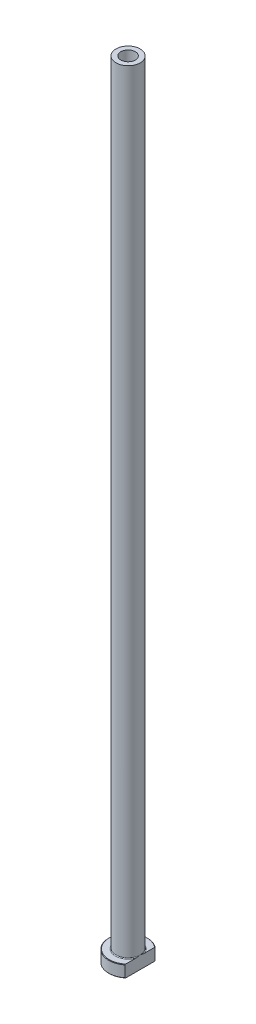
ISO-10303-21;
HEADER;
FILE_DESCRIPTION(('STEP AP214'),'2;1');
FILE_NAME('part.step','',(''),(''),'','','');
FILE_SCHEMA(('AUTOMOTIVE_DESIGN { 1 0 10303 214 1 1 1 1 }'));
ENDSEC;
DATA;
#1=APPLICATION_CONTEXT('core data for automotive mechanical design processes');
#2=APPLICATION_PROTOCOL_DEFINITION('international standard','automotive_design',2000,#1);
#3=PRODUCT_CONTEXT('',#1,'mechanical');
#4=PRODUCT('Part','Part','',(#3));
#5=PRODUCT_RELATED_PRODUCT_CATEGORY('part','',(#4));
#6=PRODUCT_DEFINITION_FORMATION('','',#4);
#7=PRODUCT_DEFINITION_CONTEXT('part definition',#1,'design');
#8=PRODUCT_DEFINITION('design','',#6,#7);
#9=PRODUCT_DEFINITION_SHAPE('','',#8);
#10=(LENGTH_UNIT() NAMED_UNIT(*) SI_UNIT(.MILLI.,.METRE.));
#11=(NAMED_UNIT(*) PLANE_ANGLE_UNIT() SI_UNIT($,.RADIAN.));
#12=(NAMED_UNIT(*) SI_UNIT($,.STERADIAN.) SOLID_ANGLE_UNIT());
#13=UNCERTAINTY_MEASURE_WITH_UNIT(LENGTH_MEASURE(1.E-05),#10,'distance_accuracy_value','');
#14=(GEOMETRIC_REPRESENTATION_CONTEXT(3) GLOBAL_UNCERTAINTY_ASSIGNED_CONTEXT((#13)) GLOBAL_UNIT_ASSIGNED_CONTEXT((#10,
#11,#12)) REPRESENTATION_CONTEXT('',''));
#15=CARTESIAN_POINT('',(0.,0.,0.));
#16=DIRECTION('',(0.,0.,1.));
#17=DIRECTION('',(1.,0.,0.));
#18=AXIS2_PLACEMENT_3D('',#15,#16,#17);
#19=CARTESIAN_POINT('',(0.,92.1876809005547,0.));
#20=DIRECTION('',(0.,1.,0.));
#21=DIRECTION('',(0.,0.,1.));
#22=AXIS2_PLACEMENT_3D('',#19,#20,#21);
#23=CYLINDRICAL_SURFACE('',#22,3.00000000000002);
#24=CARTESIAN_POINT('',(0.,325.,0.));
#25=DIRECTION('',(0.,1.,0.));
#26=DIRECTION('',(0.,0.,1.));
#27=AXIS2_PLACEMENT_3D('',#24,#25,#26);
#28=CIRCLE('',#27,3.00000000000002);
#29=CARTESIAN_POINT('',(0.,325.,3.00000000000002));
#30=VERTEX_POINT('',#29);
#31=EDGE_CURVE('E167',#30,#30,#28,.T.);
#32=ORIENTED_EDGE('',*,*,#31,.T.);
#33=EDGE_LOOP('',(#32));
#34=FACE_BOUND('',#33,.T.);
#35=CARTESIAN_POINT('',(0.,280.,0.));
#36=DIRECTION('',(0.,1.,0.));
#37=DIRECTION('',(0.,0.,1.));
#38=AXIS2_PLACEMENT_3D('',#35,#36,#37);
#39=CIRCLE('',#38,3.00000000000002);
#40=CARTESIAN_POINT('',(0.,280.,3.00000000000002));
#41=VERTEX_POINT('',#40);
#42=EDGE_CURVE('E170',#41,#41,#39,.T.);
#43=ORIENTED_EDGE('',*,*,#42,.F.);
#44=EDGE_LOOP('',(#43));
#45=FACE_BOUND('',#44,.T.);
#46=ADVANCED_FACE('F32',(#34,#45),#23,.F.);
#47=CARTESIAN_POINT('',(-3.00000000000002,325.,0.));
#48=DIRECTION('',(0.,1.,0.));
#49=DIRECTION('',(0.,0.,1.));
#50=AXIS2_PLACEMENT_3D('',#47,#48,#49);
#51=PLANE('',#50);
#52=CARTESIAN_POINT('',(0.,325.,0.));
#53=DIRECTION('',(0.,1.,0.));
#54=DIRECTION('',(0.,0.,1.));
#55=AXIS2_PLACEMENT_3D('',#52,#53,#54);
#56=CIRCLE('',#55,5.00000000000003);
#57=CARTESIAN_POINT('',(0.,325.,5.00000000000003));
#58=VERTEX_POINT('',#57);
#59=EDGE_CURVE('E174',#58,#58,#56,.T.);
#60=ORIENTED_EDGE('',*,*,#59,.T.);
#61=EDGE_LOOP('',(#60));
#62=FACE_BOUND('',#61,.T.);
#63=ORIENTED_EDGE('',*,*,#31,.F.);
#64=EDGE_LOOP('',(#63));
#65=FACE_BOUND('',#64,.T.);
#66=ADVANCED_FACE('F157',(#62,#65),#51,.T.);
#67=CARTESIAN_POINT('',(0.,92.1876809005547,0.));
#68=DIRECTION('',(0.,1.,0.));
#69=DIRECTION('',(0.,0.,1.));
#70=AXIS2_PLACEMENT_3D('',#67,#68,#69);
#71=CYLINDRICAL_SURFACE('',#70,5.00000000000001);
#72=CARTESIAN_POINT('',(0.,5.3,0.));
#73=DIRECTION('',(0.,1.,0.));
#74=DIRECTION('',(0.,0.,1.));
#75=AXIS2_PLACEMENT_3D('',#72,#73,#74);
#76=CIRCLE('',#75,5.00000000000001);
#77=CARTESIAN_POINT('',(5.,5.3,0.));
#78=VERTEX_POINT('',#77);
#79=EDGE_CURVE('E180',#78,#78,#76,.T.);
#80=ORIENTED_EDGE('',*,*,#79,.T.);
#81=EDGE_LOOP('',(#80));
#82=FACE_BOUND('',#81,.T.);
#83=ORIENTED_EDGE('',*,*,#59,.F.);
#84=EDGE_LOOP('',(#83));
#85=FACE_BOUND('',#84,.T.);
#86=ADVANCED_FACE('F162',(#82,#85),#71,.T.);
#87=CARTESIAN_POINT('',(-4.99999999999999,5.,0.));
#88=DIRECTION('',(0.,1.,0.));
#89=DIRECTION('',(0.,0.,1.));
#90=AXIS2_PLACEMENT_3D('',#87,#88,#89);
#91=PLANE('',#90);
#92=DIRECTION('',(0.,0.,1.));
#93=VECTOR('',#92,1.);
#94=CARTESIAN_POINT('',(4.99999999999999,5.,0.));
#95=LINE('',#94,#93);
#96=CARTESIAN_POINT('',(5.,5.,-5.98665181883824));
#97=VERTEX_POINT('',#96);
#98=CARTESIAN_POINT('',(4.99999999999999,5.,-1.75783958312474));
#99=VERTEX_POINT('',#98);
#100=EDGE_CURVE('E54',#97,#99,#95,.T.);
#101=ORIENTED_EDGE('',*,*,#100,.F.);
#102=CARTESIAN_POINT('',(0.,5.,0.));
#103=DIRECTION('',(0.,1.,0.));
#104=DIRECTION('',(0.,0.,1.));
#105=AXIS2_PLACEMENT_3D('',#102,#103,#104);
#106=CIRCLE('',#105,7.79999999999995);
#107=CARTESIAN_POINT('',(4.99999999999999,5.,5.98665181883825));
#108=VERTEX_POINT('',#107);
#109=EDGE_CURVE('E186',#97,#108,#106,.T.);
#110=ORIENTED_EDGE('',*,*,#109,.T.);
#111=CARTESIAN_POINT('',(4.99999999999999,5.,1.75783958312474));
#112=VERTEX_POINT('',#111);
#113=EDGE_CURVE('E134',#112,#108,#95,.T.);
#114=ORIENTED_EDGE('',*,*,#113,.F.);
#115=CARTESIAN_POINT('',(0.,5.,0.));
#116=DIRECTION('',(0.,1.,0.));
#117=DIRECTION('',(0.,0.,1.));
#118=AXIS2_PLACEMENT_3D('',#115,#116,#117);
#119=CIRCLE('',#118,5.30000000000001);
#120=EDGE_CURVE('E183',#112,#99,#119,.F.);
#121=ORIENTED_EDGE('',*,*,#120,.T.);
#122=EDGE_LOOP('',(#101,#110,#114,#121));
#123=FACE_BOUND('',#122,.T.);
#124=ADVANCED_FACE('F197',(#123),#91,.T.);
#125=CARTESIAN_POINT('',(0.,92.1876809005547,0.));
#126=DIRECTION('',(0.,1.,0.));
#127=DIRECTION('',(0.,0.,1.));
#128=AXIS2_PLACEMENT_3D('',#125,#126,#127);
#129=CYLINDRICAL_SURFACE('',#128,7.99999999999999);
#130=DIRECTION('',(0.,-1.,0.));
#131=VECTOR('',#130,1.);
#132=CARTESIAN_POINT('',(4.99999999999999,325.,6.24499799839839));
#133=LINE('',#132,#131);
#134=CARTESIAN_POINT('',(4.99999999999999,4.79999999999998,6.24499799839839));
#135=VERTEX_POINT('',#134);
#136=CARTESIAN_POINT('',(4.99999999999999,0.199999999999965,6.24499799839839));
#137=VERTEX_POINT('',#136);
#138=EDGE_CURVE('E82',#135,#137,#133,.T.);
#139=ORIENTED_EDGE('',*,*,#138,.F.);
#140=CARTESIAN_POINT('',(0.,4.79999999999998,0.));
#141=DIRECTION('',(0.,1.,0.));
#142=DIRECTION('',(0.,0.,1.));
#143=AXIS2_PLACEMENT_3D('',#140,#141,#142);
#144=CIRCLE('',#143,7.99999999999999);
#145=CARTESIAN_POINT('',(5.,4.79999999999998,-6.24499799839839));
#146=VERTEX_POINT('',#145);
#147=EDGE_CURVE('E95',#135,#146,#144,.F.);
#148=ORIENTED_EDGE('',*,*,#147,.T.);
#149=DIRECTION('',(0.,-1.,0.));
#150=VECTOR('',#149,1.);
#151=CARTESIAN_POINT('',(5.,325.,-6.24499799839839));
#152=LINE('',#151,#150);
#153=CARTESIAN_POINT('',(5.,0.199999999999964,-6.24499799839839));
#154=VERTEX_POINT('',#153);
#155=EDGE_CURVE('E192',#146,#154,#152,.T.);
#156=ORIENTED_EDGE('',*,*,#155,.T.);
#157=CARTESIAN_POINT('',(0.,0.199999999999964,0.));
#158=DIRECTION('',(0.,-1.,0.));
#159=DIRECTION('',(0.,0.,-1.));
#160=AXIS2_PLACEMENT_3D('',#157,#158,#159);
#161=CIRCLE('',#160,7.99999999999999);
#162=EDGE_CURVE('E98',#154,#137,#161,.F.);
#163=ORIENTED_EDGE('',*,*,#162,.T.);
#164=EDGE_LOOP('',(#139,#148,#156,#163));
#165=FACE_BOUND('',#164,.T.);
#166=ADVANCED_FACE('F190',(#165),#129,.T.);
#167=CARTESIAN_POINT('',(-7.99999999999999,0.,0.));
#168=DIRECTION('',(0.,-1.,0.));
#169=DIRECTION('',(0.,0.,-1.));
#170=AXIS2_PLACEMENT_3D('',#167,#168,#169);
#171=PLANE('',#170);
#172=CARTESIAN_POINT('',(0.,0.,0.));
#173=DIRECTION('',(0.,-1.,0.));
#174=DIRECTION('',(0.,0.,-1.));
#175=AXIS2_PLACEMENT_3D('',#172,#173,#174);
#176=CIRCLE('',#175,3.74999999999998);
#177=CARTESIAN_POINT('',(0.,0.,-3.74999999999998));
#178=VERTEX_POINT('',#177);
#179=EDGE_CURVE('E40',#178,#178,#176,.F.);
#180=ORIENTED_EDGE('',*,*,#179,.T.);
#181=EDGE_LOOP('',(#180));
#182=FACE_BOUND('',#181,.T.);
#183=DIRECTION('',(0.,0.,-1.));
#184=VECTOR('',#183,1.);
#185=CARTESIAN_POINT('',(4.99999999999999,0.,6.24499799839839));
#186=LINE('',#185,#184);
#187=CARTESIAN_POINT('',(4.99999999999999,0.,5.98665181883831));
#188=VERTEX_POINT('',#187);
#189=CARTESIAN_POINT('',(5.,0.,-5.98665181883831));
#190=VERTEX_POINT('',#189);
#191=EDGE_CURVE('E47',#188,#190,#186,.T.);
#192=ORIENTED_EDGE('',*,*,#191,.F.);
#193=CARTESIAN_POINT('',(0.,0.,0.));
#194=DIRECTION('',(0.,-1.,0.));
#195=DIRECTION('',(0.,0.,-1.));
#196=AXIS2_PLACEMENT_3D('',#193,#194,#195);
#197=CIRCLE('',#196,7.8);
#198=EDGE_CURVE('E92',#188,#190,#197,.T.);
#199=ORIENTED_EDGE('',*,*,#198,.T.);
#200=EDGE_LOOP('',(#192,#199));
#201=FACE_BOUND('',#200,.T.);
#202=ADVANCED_FACE('F91',(#182,#201),#171,.T.);
#203=CARTESIAN_POINT('',(0.,92.1876809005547,0.));
#204=DIRECTION('',(0.,1.,0.));
#205=DIRECTION('',(0.,0.,1.));
#206=AXIS2_PLACEMENT_3D('',#203,#204,#205);
#207=CYLINDRICAL_SURFACE('',#206,3.25000000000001);
#208=CARTESIAN_POINT('',(0.,0.499999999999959,0.));
#209=DIRECTION('',(0.,-1.,0.));
#210=DIRECTION('',(0.,0.,-1.));
#211=AXIS2_PLACEMENT_3D('',#208,#209,#210);
#212=CIRCLE('',#211,3.25000000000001);
#213=CARTESIAN_POINT('',(0.,0.499999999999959,-3.25000000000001));
#214=VERTEX_POINT('',#213);
#215=EDGE_CURVE('E11',#214,#214,#212,.T.);
#216=ORIENTED_EDGE('',*,*,#215,.T.);
#217=EDGE_LOOP('',(#216));
#218=FACE_BOUND('',#217,.T.);
#219=CARTESIAN_POINT('',(0.,268.,0.));
#220=DIRECTION('',(0.,1.,0.));
#221=DIRECTION('',(0.,0.,1.));
#222=AXIS2_PLACEMENT_3D('',#219,#220,#221);
#223=CIRCLE('',#222,3.25000000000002);
#224=CARTESIAN_POINT('',(0.,268.,3.25000000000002));
#225=VERTEX_POINT('',#224);
#226=EDGE_CURVE('E172',#225,#225,#223,.T.);
#227=ORIENTED_EDGE('',*,*,#226,.T.);
#228=EDGE_LOOP('',(#227));
#229=FACE_BOUND('',#228,.T.);
#230=ADVANCED_FACE('F215',(#218,#229),#207,.F.);
#231=CARTESIAN_POINT('',(0.,268.,0.));
#232=DIRECTION('',(0.,-1.,0.));
#233=DIRECTION('',(0.,0.,-1.));
#234=AXIS2_PLACEMENT_3D('',#231,#232,#233);
#235=CONICAL_SURFACE('',#234,3.25000000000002,0.0208303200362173);
#236=ORIENTED_EDGE('',*,*,#42,.T.);
#237=EDGE_LOOP('',(#236));
#238=FACE_BOUND('',#237,.T.);
#239=ORIENTED_EDGE('',*,*,#226,.F.);
#240=EDGE_LOOP('',(#239));
#241=FACE_BOUND('',#240,.T.);
#242=ADVANCED_FACE('F111',(#238,#241),#235,.F.);
#243=CARTESIAN_POINT('',(0.,5.3,0.));
#244=DIRECTION('',(0.,1.,0.));
#245=DIRECTION('',(0.,0.,1.));
#246=AXIS2_PLACEMENT_3D('',#243,#244,#245);
#247=TOROIDAL_SURFACE('',#246,5.30000000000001,0.3);
#248=ORIENTED_EDGE('',*,*,#120,.F.);
#249=CARTESIAN_POINT('',(5.,5.3,0.));
#250=CARTESIAN_POINT('',(5.,5.30000062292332,-1.31468687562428E-10));
#251=CARTESIAN_POINT('',(5.,5.3000012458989,2.52759469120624E-07));
#252=CARTESIAN_POINT('',(5.,5.30000240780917,9.47164861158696E-07));
#253=CARTESIAN_POINT('',(5.,5.30000293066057,1.40594095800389E-06));
#254=CARTESIAN_POINT('',(5.,5.30000402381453,2.50637688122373E-06));
#255=CARTESIAN_POINT('',(5.,5.3000045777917,3.16589008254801E-06));
#256=CARTESIAN_POINT('',(5.,5.30000556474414,4.52860077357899E-06));
#257=CARTESIAN_POINT('',(5.,5.30000600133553,5.22939552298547E-06));
#258=CARTESIAN_POINT('',(5.,5.30000763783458,7.96122160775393E-06));
#259=CARTESIAN_POINT('',(5.,5.30000875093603,1.00477432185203E-05));
#260=CARTESIAN_POINT('',(5.,5.30001056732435,1.41660899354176E-05));
#261=CARTESIAN_POINT('',(5.,5.30001129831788,1.61861806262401E-05));
#262=CARTESIAN_POINT('',(5.,5.3000143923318,2.47865779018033E-05));
#263=CARTESIAN_POINT('',(5.,5.30001672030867,3.13830336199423E-05));
#264=CARTESIAN_POINT('',(5.,5.30002012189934,4.38084281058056E-05));
#265=CARTESIAN_POINT('',(5.,5.30002133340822,4.95992793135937E-05));
#266=CARTESIAN_POINT('',(5.,5.3000302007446,9.27862697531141E-05));
#267=CARTESIAN_POINT('',(5.,5.30003696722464,0.000130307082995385));
#268=CARTESIAN_POINT('',(4.99999999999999,5.30006659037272,0.000278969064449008));
#269=CARTESIAN_POINT('',(5.,5.30009481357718,0.00038902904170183));
#270=CARTESIAN_POINT('',(5.,5.30020506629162,0.000826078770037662));
#271=CARTESIAN_POINT('',(5.,5.30028365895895,0.00115365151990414));
#272=CARTESIAN_POINT('',(4.99999999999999,5.30059919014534,0.00245925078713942));
#273=CARTESIAN_POINT('',(4.99999999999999,5.30084048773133,0.00343651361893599));
#274=CARTESIAN_POINT('',(5.,5.30184626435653,0.00752058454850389));
#275=CARTESIAN_POINT('',(5.,5.30260525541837,0.0106283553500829));
#276=CARTESIAN_POINT('',(4.99999999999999,5.30996461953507,0.0407482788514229));
#277=CARTESIAN_POINT('',(4.99999999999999,5.31658985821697,0.0677561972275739));
#278=CARTESIAN_POINT('',(5.,5.32953319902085,0.120688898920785));
#279=CARTESIAN_POINT('',(5.,5.33585289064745,0.146613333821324));
#280=CARTESIAN_POINT('',(4.99999999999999,5.34926050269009,0.201795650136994));
#281=CARTESIAN_POINT('',(5.,5.35634306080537,0.231054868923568));
#282=CARTESIAN_POINT('',(5.,5.37050252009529,0.289917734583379));
#283=CARTESIAN_POINT('',(5.,5.3775784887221,0.319521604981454));
#284=CARTESIAN_POINT('',(5.,5.39452602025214,0.391032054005));
#285=CARTESIAN_POINT('',(5.,5.40434071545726,0.432952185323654));
#286=CARTESIAN_POINT('',(5.,5.42340141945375,0.515763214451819));
#287=CARTESIAN_POINT('',(5.,5.43265559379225,0.55665223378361));
#288=CARTESIAN_POINT('',(5.,5.45710553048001,0.667075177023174));
#289=CARTESIAN_POINT('',(5.,5.47194176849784,0.73668976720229));
#290=CARTESIAN_POINT('',(5.,5.50018229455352,0.876836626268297));
#291=CARTESIAN_POINT('',(5.,5.51357312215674,0.947371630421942));
#292=CARTESIAN_POINT('',(5.,5.53930921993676,1.09497328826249));
#293=CARTESIAN_POINT('',(5.,5.55146217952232,1.17207432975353));
#294=CARTESIAN_POINT('',(5.,5.57239669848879,1.3267264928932));
#295=CARTESIAN_POINT('',(5.,5.58117877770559,1.40427754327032));
#296=CARTESIAN_POINT('',(5.,5.59499725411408,1.56873827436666));
#297=CARTESIAN_POINT('',(5.,5.59948802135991,1.65570044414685));
#298=CARTESIAN_POINT('',(5.,5.60018885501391,1.78535304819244));
#299=CARTESIAN_POINT('',(5.,5.59945214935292,1.82802575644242));
#300=CARTESIAN_POINT('',(5.,5.59559364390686,1.91325081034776));
#301=CARTESIAN_POINT('',(5.,5.59247319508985,1.9558032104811));
#302=CARTESIAN_POINT('',(5.,5.58383242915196,2.03512365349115));
#303=CARTESIAN_POINT('',(5.,5.57867386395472,2.07192937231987));
#304=CARTESIAN_POINT('',(5.,5.56543793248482,2.14526756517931));
#305=CARTESIAN_POINT('',(5.,5.55734203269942,2.18179676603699));
#306=CARTESIAN_POINT('',(5.,5.53718005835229,2.25427226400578));
#307=CARTESIAN_POINT('',(5.,5.52507057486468,2.29020746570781));
#308=CARTESIAN_POINT('',(5.,5.5027092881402,2.3422302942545));
#309=CARTESIAN_POINT('',(5.,5.49457811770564,2.35922314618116));
#310=CARTESIAN_POINT('',(5.,5.47657809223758,2.39224900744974));
#311=CARTESIAN_POINT('',(5.,5.46671281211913,2.40828390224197));
#312=CARTESIAN_POINT('',(5.,5.44695893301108,2.43579467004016));
#313=CARTESIAN_POINT('',(5.,5.43745879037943,2.44754592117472));
#314=CARTESIAN_POINT('',(5.,5.41677914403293,2.46946476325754));
#315=CARTESIAN_POINT('',(5.,5.40560543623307,2.47963758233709));
#316=CARTESIAN_POINT('',(5.,5.38617750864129,2.49393642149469));
#317=CARTESIAN_POINT('',(5.,5.37851643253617,2.49886271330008));
#318=CARTESIAN_POINT('',(5.,5.36252740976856,2.50749953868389));
#319=CARTESIAN_POINT('',(5.,5.35419984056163,2.51121075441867));
#320=CARTESIAN_POINT('',(5.,5.33690648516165,2.51712941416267));
#321=CARTESIAN_POINT('',(5.,5.32793451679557,2.5193192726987));
#322=CARTESIAN_POINT('',(5.,5.30973576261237,2.52185978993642));
#323=CARTESIAN_POINT('',(5.,5.30050931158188,2.52221275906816));
#324=CARTESIAN_POINT('',(5.,5.28349166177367,2.52112455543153));
#325=CARTESIAN_POINT('',(5.,5.27568322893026,2.51993178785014));
#326=CARTESIAN_POINT('',(5.,5.26036860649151,2.51628294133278));
#327=CARTESIAN_POINT('',(5.,5.252862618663,2.51382603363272));
#328=CARTESIAN_POINT('',(5.,5.23590266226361,2.50685484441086));
#329=CARTESIAN_POINT('',(5.,5.22661875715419,2.50192984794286));
#330=CARTESIAN_POINT('',(5.,5.20895514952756,2.49066548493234));
#331=CARTESIAN_POINT('',(5.,5.20057756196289,2.48432291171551));
#332=CARTESIAN_POINT('',(5.,5.17987008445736,2.46645212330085));
#333=CARTESIAN_POINT('',(5.,5.16824151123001,2.4541186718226));
#334=CARTESIAN_POINT('',(5.,5.14692461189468,2.42790849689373));
#335=CARTESIAN_POINT('',(5.,5.13723987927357,2.41402898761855));
#336=CARTESIAN_POINT('',(5.,5.110807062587,2.37143175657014));
#337=CARTESIAN_POINT('',(5.,5.09628770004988,2.34134703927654));
#338=CARTESIAN_POINT('',(5.,5.07130349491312,2.27940731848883));
#339=CARTESIAN_POINT('',(5.,5.06087110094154,2.24754035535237));
#340=CARTESIAN_POINT('',(5.,5.03890359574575,2.16787245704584));
#341=CARTESIAN_POINT('',(5.,5.02913523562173,2.11959065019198));
#342=CARTESIAN_POINT('',(5.,5.01416953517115,2.02224928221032));
#343=CARTESIAN_POINT('',(5.,5.00898637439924,1.97318778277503));
#344=CARTESIAN_POINT('',(5.,5.0022082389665,1.87635767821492));
#345=CARTESIAN_POINT('',(5.,5.00050709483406,1.82859609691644));
#346=CARTESIAN_POINT('',(5.,4.99969104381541,1.73330165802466));
#347=CARTESIAN_POINT('',(5.,5.00056327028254,1.68576884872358));
#348=CARTESIAN_POINT('',(5.,5.00484296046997,1.57937770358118));
#349=CARTESIAN_POINT('',(5.,5.00880932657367,1.52054285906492));
#350=CARTESIAN_POINT('',(5.,5.01925964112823,1.40312974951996));
#351=CARTESIAN_POINT('',(5.,5.02574264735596,1.34455139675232));
#352=CARTESIAN_POINT('',(5.,5.04090087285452,1.22627662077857));
#353=CARTESIAN_POINT('',(5.,5.04962425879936,1.16658647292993));
#354=CARTESIAN_POINT('',(5.,5.06877923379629,1.04732463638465));
#355=CARTESIAN_POINT('',(5.,5.07921523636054,0.987753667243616));
#356=CARTESIAN_POINT('',(5.,5.10551698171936,0.846936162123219));
#357=CARTESIAN_POINT('',(5.,5.12196565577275,0.765799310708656));
#358=CARTESIAN_POINT('',(5.,5.15639716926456,0.604819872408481));
#359=CARTESIAN_POINT('',(5.,5.17436050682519,0.524973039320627));
#360=CARTESIAN_POINT('',(4.99999999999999,5.20921667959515,0.374726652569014));
#361=CARTESIAN_POINT('',(4.99999999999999,5.2259938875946,0.30430004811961));
#362=CARTESIAN_POINT('',(5.,5.25191105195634,0.196907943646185));
#363=CARTESIAN_POINT('',(5.,5.26090146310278,0.159905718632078));
#364=CARTESIAN_POINT('',(4.99999999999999,5.27881854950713,0.0865164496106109));
#365=CARTESIAN_POINT('',(4.99999999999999,5.28774391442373,0.0501291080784));
#366=CARTESIAN_POINT('',(5.,5.29739627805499,0.0106218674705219));
#367=CARTESIAN_POINT('',(5.,5.29815688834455,0.00750762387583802));
#368=CARTESIAN_POINT('',(4.99999999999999,5.29916304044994,0.00342209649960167));
#369=CARTESIAN_POINT('',(4.99999999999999,5.29940309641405,0.00244985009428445));
#370=CARTESIAN_POINT('',(5.,5.29971711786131,0.00115049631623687));
#371=CARTESIAN_POINT('',(5.,5.29979541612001,0.000824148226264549));
#372=CARTESIAN_POINT('',(5.,5.29990531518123,0.000388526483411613));
#373=CARTESIAN_POINT('',(4.99999999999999,5.29993348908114,0.000278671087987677));
#374=CARTESIAN_POINT('',(5.,5.2999630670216,0.000130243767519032));
#375=CARTESIAN_POINT('',(5.,5.29996982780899,9.27511463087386E-05));
#376=CARTESIAN_POINT('',(5.,5.29997868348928,4.95929943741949E-05));
#377=CARTESIAN_POINT('',(5.,5.29997989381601,4.38036616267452E-05));
#378=CARTESIAN_POINT('',(5.,5.29998329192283,3.13814238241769E-05));
#379=CARTESIAN_POINT('',(5.,5.2999856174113,2.47865257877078E-05));
#380=CARTESIAN_POINT('',(5.,5.29998870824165,1.61877569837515E-05));
#381=CARTESIAN_POINT('',(5.,5.29998943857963,1.41677794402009E-05));
#382=CARTESIAN_POINT('',(5.,5.29999125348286,1.00495553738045E-05));
#383=CARTESIAN_POINT('',(5.,5.29999236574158,7.96302835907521E-06));
#384=CARTESIAN_POINT('',(5.,5.29999400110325,5.23107523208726E-06));
#385=CARTESIAN_POINT('',(5.,5.29999443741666,4.53021146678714E-06));
#386=CARTESIAN_POINT('',(5.,5.29999542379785,3.16731256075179E-06));
#387=CARTESIAN_POINT('',(5.,5.29999597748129,2.5076780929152E-06));
#388=CARTESIAN_POINT('',(5.,5.29999707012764,1.40695937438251E-06));
#389=CARTESIAN_POINT('',(5.,5.29999759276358,9.48032966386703E-07));
#390=CARTESIAN_POINT('',(5.,5.29999875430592,2.53244576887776E-07));
#391=CARTESIAN_POINT('',(5.,5.29999937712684,1.31459489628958E-10));
#392=CARTESIAN_POINT('',(5.,5.3,0.));
#393=B_SPLINE_CURVE_WITH_KNOTS('',3,(#249,#250,#251,#252,#253,#254,#255,#256,#257,#258,#259,
#260,#261,#262,#263,#264,#265,#266,#267,#268,#269,#270,#271,#272,#273,#274,#275,#276,#277,#278,
#279,#280,#281,#282,#283,#284,#285,#286,#287,#288,#289,#290,#291,#292,#293,#294,#295,#296,#297,
#298,#299,#300,#301,#302,#303,#304,#305,#306,#307,#308,#309,#310,#311,#312,#313,#314,#315,#316,
#317,#318,#319,#320,#321,#322,#323,#324,#325,#326,#327,#328,#329,#330,#331,#332,#333,#334,#335,
#336,#337,#338,#339,#340,#341,#342,#343,#344,#345,#346,#347,#348,#349,#350,#351,#352,#353,#354,
#355,#356,#357,#358,#359,#360,#361,#362,#363,#364,#365,#366,#367,#368,#369,#370,#371,#372,#373,
#374,#375,#376,#377,#378,#379,#380,#381,#382,#383,#384,#385,#386,#387,#388,#389,#390,#391,#392),
.UNSPECIFIED.,.T.,.F.,(4,2,2,2,2,2,2,2,2,2,2,2,2,2,2,2,2,2,2,2,2,2,2,2,2,2,2,2,2,2,2,2,2,2,2,2,
2,2,2,2,2,2,2,2,2,2,2,2,2,2,2,2,2,2,2,2,2,2,2,2,2,2,2,2,2,2,2,2,2,2,2,4),(0.,
1.88939009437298E-06,3.98058369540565E-06,6.54817872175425E-06,9.02403514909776E-06,
1.60938652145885E-05,2.2532807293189E-05,4.34843803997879E-05,6.12120045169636E-05,
0.000175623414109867,0.000516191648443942,0.00152710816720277,0.00454656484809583,
0.0141443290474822,0.097567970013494,0.177619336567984,0.267931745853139,0.359245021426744,
0.488405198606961,0.614173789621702,0.82769427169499,1.0430571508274,1.27715608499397,
1.51121890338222,1.77214751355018,1.90013509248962,2.02805018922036,2.13945459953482,
2.25157451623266,2.3649489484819,2.42139235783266,2.47772074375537,2.52293802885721,
2.56800219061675,2.59524342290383,2.62246933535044,2.65000494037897,2.67750590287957,
2.70108948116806,2.72468854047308,2.75603978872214,2.78746268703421,2.83802806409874,
2.88868607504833,2.98834295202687,3.08877575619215,3.23618650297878,3.38405153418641,
3.52733651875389,3.66990630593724,3.84673903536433,4.02350562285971,4.20444776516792,
4.38586374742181,4.63419556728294,4.87971270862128,5.09690175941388,5.21113882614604,
5.32353360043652,5.33315137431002,5.33615533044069,5.3371624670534,5.33750240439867,
5.33761672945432,5.33763445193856,5.33765539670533,5.33766183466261,5.33766890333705,
5.33767137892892,5.33767394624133,5.33767603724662,5.33767792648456),.UNSPECIFIED.);
#394=EDGE_CURVE('E126',#112,#78,#393,.T.);
#395=ORIENTED_EDGE('',*,*,#394,.T.);
#396=ORIENTED_EDGE('',*,*,#79,.F.);
#397=CARTESIAN_POINT('',(5.,5.3,0.));
#398=CARTESIAN_POINT('',(5.,5.29999937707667,1.31470312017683E-10));
#399=CARTESIAN_POINT('',(5.,5.29999875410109,-2.52759467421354E-07));
#400=CARTESIAN_POINT('',(5.,5.29999759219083,-9.47164859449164E-07));
#401=CARTESIAN_POINT('',(5.,5.29999706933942,-1.40594095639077E-06));
#402=CARTESIAN_POINT('',(5.,5.29999597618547,-2.50637687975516E-06));
#403=CARTESIAN_POINT('',(5.,5.2999954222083,-3.16589008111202E-06));
#404=CARTESIAN_POINT('',(5.,5.29999443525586,-4.52860077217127E-06));
#405=CARTESIAN_POINT('',(5.,5.29999399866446,-5.22939552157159E-06));
#406=CARTESIAN_POINT('',(5.,5.29999236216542,-7.96122160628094E-06));
#407=CARTESIAN_POINT('',(5.,5.29999124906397,-1.00477432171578E-05));
#408=CARTESIAN_POINT('',(5.,5.29998943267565,-1.41660899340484E-05));
#409=CARTESIAN_POINT('',(5.,5.29998870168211,-1.61861806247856E-05));
#410=CARTESIAN_POINT('',(5.,5.2999856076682,-2.47865779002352E-05));
#411=CARTESIAN_POINT('',(5.,5.29998327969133,-3.13830336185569E-05));
#412=CARTESIAN_POINT('',(5.,5.29997987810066,-4.38084281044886E-05));
#413=CARTESIAN_POINT('',(5.,5.29997866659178,-4.95992793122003E-05));
#414=CARTESIAN_POINT('',(5.,5.29996979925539,-9.27862697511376E-05));
#415=CARTESIAN_POINT('',(5.,5.29996303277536,-0.000130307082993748));
#416=CARTESIAN_POINT('',(4.99999999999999,5.29993340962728,-0.000278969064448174));
#417=CARTESIAN_POINT('',(5.,5.29990518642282,-0.000389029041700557));
#418=CARTESIAN_POINT('',(5.,5.29979493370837,-0.000826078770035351));
#419=CARTESIAN_POINT('',(5.,5.29971634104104,-0.00115365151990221));
#420=CARTESIAN_POINT('',(4.99999999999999,5.29940080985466,-0.00245925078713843));
#421=CARTESIAN_POINT('',(4.99999999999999,5.29915951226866,-0.00343651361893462));
#422=CARTESIAN_POINT('',(5.,5.29815373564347,-0.00752058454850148));
#423=CARTESIAN_POINT('',(5.,5.29739474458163,-0.010628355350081));
#424=CARTESIAN_POINT('',(4.99999999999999,5.29003538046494,-0.0407482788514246));
#425=CARTESIAN_POINT('',(4.99999999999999,5.28341014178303,-0.067756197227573));
#426=CARTESIAN_POINT('',(5.,5.27046680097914,-0.120688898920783));
#427=CARTESIAN_POINT('',(5.,5.26414710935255,-0.146613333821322));
#428=CARTESIAN_POINT('',(4.99999999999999,5.25073949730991,-0.201795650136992));
#429=CARTESIAN_POINT('',(5.,5.24365693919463,-0.231054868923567));
#430=CARTESIAN_POINT('',(5.,5.22949747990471,-0.289917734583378));
#431=CARTESIAN_POINT('',(5.,5.2224215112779,-0.319521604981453));
#432=CARTESIAN_POINT('',(5.,5.20547397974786,-0.391032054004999));
#433=CARTESIAN_POINT('',(5.,5.19565928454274,-0.432952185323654));
#434=CARTESIAN_POINT('',(5.,5.17659858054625,-0.515763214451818));
#435=CARTESIAN_POINT('',(5.,5.16734440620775,-0.556652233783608));
#436=CARTESIAN_POINT('',(5.,5.14289446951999,-0.667075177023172));
#437=CARTESIAN_POINT('',(5.,5.12805823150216,-0.736689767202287));
#438=CARTESIAN_POINT('',(5.,5.09981770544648,-0.876836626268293));
#439=CARTESIAN_POINT('',(5.,5.08642687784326,-0.947371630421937));
#440=CARTESIAN_POINT('',(5.,5.06069078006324,-1.09497328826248));
#441=CARTESIAN_POINT('',(5.,5.04853782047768,-1.17207432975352));
#442=CARTESIAN_POINT('',(5.,5.02760330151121,-1.32672649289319));
#443=CARTESIAN_POINT('',(5.,5.01882122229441,-1.40427754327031));
#444=CARTESIAN_POINT('',(5.,5.00500274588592,-1.56873827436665));
#445=CARTESIAN_POINT('',(5.,5.00051197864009,-1.65570044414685));
#446=CARTESIAN_POINT('',(5.,4.99981114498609,-1.78535304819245));
#447=CARTESIAN_POINT('',(5.,5.00054785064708,-1.82802575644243));
#448=CARTESIAN_POINT('',(5.,5.00440635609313,-1.91325081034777));
#449=CARTESIAN_POINT('',(5.,5.00752680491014,-1.95580321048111));
#450=CARTESIAN_POINT('',(5.,5.01616757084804,-2.03512365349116));
#451=CARTESIAN_POINT('',(5.,5.02132613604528,-2.07192937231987));
#452=CARTESIAN_POINT('',(5.,5.03456206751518,-2.1452675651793));
#453=CARTESIAN_POINT('',(5.,5.04265796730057,-2.18179676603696));
#454=CARTESIAN_POINT('',(5.,5.0628199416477,-2.25427226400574));
#455=CARTESIAN_POINT('',(5.,5.0749294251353,-2.29020746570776));
#456=CARTESIAN_POINT('',(5.,5.09729071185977,-2.34223029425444));
#457=CARTESIAN_POINT('',(5.,5.10542188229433,-2.3592231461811));
#458=CARTESIAN_POINT('',(5.,5.12342190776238,-2.39224900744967));
#459=CARTESIAN_POINT('',(5.,5.13328718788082,-2.4082839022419));
#460=CARTESIAN_POINT('',(5.,5.15304106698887,-2.4357946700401));
#461=CARTESIAN_POINT('',(5.,5.16254120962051,-2.44754592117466));
#462=CARTESIAN_POINT('',(5.,5.18322085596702,-2.4694647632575));
#463=CARTESIAN_POINT('',(5.,5.19439456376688,-2.47963758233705));
#464=CARTESIAN_POINT('',(5.,5.21382249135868,-2.49393642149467));
#465=CARTESIAN_POINT('',(5.,5.22148356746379,-2.49886271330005));
#466=CARTESIAN_POINT('',(5.,5.2374725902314,-2.50749953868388));
#467=CARTESIAN_POINT('',(5.,5.24580015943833,-2.51121075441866));
#468=CARTESIAN_POINT('',(5.,5.26309351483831,-2.51712941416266));
#469=CARTESIAN_POINT('',(5.,5.27206548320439,-2.51931927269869));
#470=CARTESIAN_POINT('',(5.,5.29026423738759,-2.52185978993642));
#471=CARTESIAN_POINT('',(5.,5.29949068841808,-2.52221275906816));
#472=CARTESIAN_POINT('',(5.,5.31650833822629,-2.52112455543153));
#473=CARTESIAN_POINT('',(5.,5.3243167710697,-2.51993178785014));
#474=CARTESIAN_POINT('',(5.,5.33963139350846,-2.51628294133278));
#475=CARTESIAN_POINT('',(5.,5.34713738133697,-2.51382603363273));
#476=CARTESIAN_POINT('',(5.,5.36409733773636,-2.50685484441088));
#477=CARTESIAN_POINT('',(5.,5.37338124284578,-2.50192984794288));
#478=CARTESIAN_POINT('',(5.,5.3910448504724,-2.49066548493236));
#479=CARTESIAN_POINT('',(5.,5.39942243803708,-2.48432291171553));
#480=CARTESIAN_POINT('',(5.,5.42012991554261,-2.46645212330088));
#481=CARTESIAN_POINT('',(5.,5.43175848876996,-2.45411867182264));
#482=CARTESIAN_POINT('',(5.,5.45307538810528,-2.42790849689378));
#483=CARTESIAN_POINT('',(5.,5.46276012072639,-2.4140289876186));
#484=CARTESIAN_POINT('',(5.,5.48919293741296,-2.37143175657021));
#485=CARTESIAN_POINT('',(5.,5.50371229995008,-2.34134703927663));
#486=CARTESIAN_POINT('',(5.,5.52869650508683,-2.27940731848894));
#487=CARTESIAN_POINT('',(5.,5.53912889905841,-2.2475403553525));
#488=CARTESIAN_POINT('',(5.,5.56109640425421,-2.16787245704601));
#489=CARTESIAN_POINT('',(5.,5.57086476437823,-2.11959065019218));
#490=CARTESIAN_POINT('',(5.,5.58583046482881,-2.02224928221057));
#491=CARTESIAN_POINT('',(5.,5.59101362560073,-1.97318778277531));
#492=CARTESIAN_POINT('',(5.,5.59779176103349,-1.87635767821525));
#493=CARTESIAN_POINT('',(5.,5.59949290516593,-1.8285960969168));
#494=CARTESIAN_POINT('',(5.,5.60030895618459,-1.73330165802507));
#495=CARTESIAN_POINT('',(5.,5.59943672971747,-1.68576884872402));
#496=CARTESIAN_POINT('',(5.,5.59515703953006,-1.57937770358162));
#497=CARTESIAN_POINT('',(5.,5.59119067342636,-1.52054285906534));
#498=CARTESIAN_POINT('',(5.,5.58074035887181,-1.40312974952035));
#499=CARTESIAN_POINT('',(5.,5.57425735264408,-1.34455139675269));
#500=CARTESIAN_POINT('',(5.,5.55909912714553,-1.22627662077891));
#501=CARTESIAN_POINT('',(5.,5.55037574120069,-1.16658647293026));
#502=CARTESIAN_POINT('',(5.,5.53122076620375,-1.04732463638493));
#503=CARTESIAN_POINT('',(5.,5.52078476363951,-0.987753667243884));
#504=CARTESIAN_POINT('',(5.,5.49448301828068,-0.846936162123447));
#505=CARTESIAN_POINT('',(4.99999999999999,5.47803434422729,-0.765799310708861));
#506=CARTESIAN_POINT('',(5.,5.44360283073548,-0.604819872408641));
#507=CARTESIAN_POINT('',(5.,5.42563949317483,-0.524973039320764));
#508=CARTESIAN_POINT('',(4.99999999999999,5.39078332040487,-0.374726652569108));
#509=CARTESIAN_POINT('',(4.99999999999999,5.37400611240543,-0.304300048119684));
#510=CARTESIAN_POINT('',(5.,5.34808894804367,-0.196907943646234));
#511=CARTESIAN_POINT('',(5.00000000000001,5.33909853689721,-0.15990571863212));
#512=CARTESIAN_POINT('',(4.99999999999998,5.32118145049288,-0.0865164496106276));
#513=CARTESIAN_POINT('',(4.99999999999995,5.31225608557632,-0.0501291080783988));
#514=CARTESIAN_POINT('',(5.,5.302603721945,-0.0106218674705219));
#515=CARTESIAN_POINT('',(5.,5.30184311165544,-0.00750762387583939));
#516=CARTESIAN_POINT('',(4.99999999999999,5.30083695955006,-0.00342209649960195));
#517=CARTESIAN_POINT('',(4.99999999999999,5.30059690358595,-0.00244985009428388));
#518=CARTESIAN_POINT('',(5.,5.30028288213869,-0.00115049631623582));
#519=CARTESIAN_POINT('',(5.,5.30020458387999,-0.000824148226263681));
#520=CARTESIAN_POINT('',(4.99999999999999,5.30009468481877,-0.000388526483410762));
#521=CARTESIAN_POINT('',(4.99999999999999,5.30006651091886,-0.000278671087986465));
#522=CARTESIAN_POINT('',(5.,5.30003693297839,-0.000130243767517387));
#523=CARTESIAN_POINT('',(5.,5.30003017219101,-9.27511463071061E-05));
#524=CARTESIAN_POINT('',(5.,5.30002131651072,-4.95929943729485E-05));
#525=CARTESIAN_POINT('',(5.,5.30002010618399,-4.38036616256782E-05));
#526=CARTESIAN_POINT('',(5.,5.30001670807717,-3.13814238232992E-05));
#527=CARTESIAN_POINT('',(5.,5.3000143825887,-2.47865257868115E-05));
#528=CARTESIAN_POINT('',(5.,5.30001129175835,-1.61877569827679E-05));
#529=CARTESIAN_POINT('',(5.,5.30001056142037,-1.41677794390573E-05));
#530=CARTESIAN_POINT('',(5.,5.30000874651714,-1.00495553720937E-05));
#531=CARTESIAN_POINT('',(5.,5.30000763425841,-7.96302835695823E-06));
#532=CARTESIAN_POINT('',(5.,5.30000599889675,-5.23107523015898E-06));
#533=CARTESIAN_POINT('',(5.,5.30000556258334,-4.53021146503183E-06));
#534=CARTESIAN_POINT('',(5.,5.30000457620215,-3.16731255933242E-06));
#535=CARTESIAN_POINT('',(5.,5.30000402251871,-2.50767809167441E-06));
#536=CARTESIAN_POINT('',(5.,5.30000292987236,-1.40695937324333E-06));
#537=CARTESIAN_POINT('',(5.,5.30000240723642,-9.48032965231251E-07));
#538=CARTESIAN_POINT('',(5.,5.30000124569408,-2.53244575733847E-07));
#539=CARTESIAN_POINT('',(5.,5.30000062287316,-1.31458336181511E-10));
#540=CARTESIAN_POINT('',(5.,5.3,0.));
#541=B_SPLINE_CURVE_WITH_KNOTS('',3,(#397,#398,#399,#400,#401,#402,#403,#404,#405,#406,#407,
#408,#409,#410,#411,#412,#413,#414,#415,#416,#417,#418,#419,#420,#421,#422,#423,#424,#425,#426,
#427,#428,#429,#430,#431,#432,#433,#434,#435,#436,#437,#438,#439,#440,#441,#442,#443,#444,#445,
#446,#447,#448,#449,#450,#451,#452,#453,#454,#455,#456,#457,#458,#459,#460,#461,#462,#463,#464,
#465,#466,#467,#468,#469,#470,#471,#472,#473,#474,#475,#476,#477,#478,#479,#480,#481,#482,#483,
#484,#485,#486,#487,#488,#489,#490,#491,#492,#493,#494,#495,#496,#497,#498,#499,#500,#501,#502,
#503,#504,#505,#506,#507,#508,#509,#510,#511,#512,#513,#514,#515,#516,#517,#518,#519,#520,#521,
#522,#523,#524,#525,#526,#527,#528,#529,#530,#531,#532,#533,#534,#535,#536,#537,#538,#539,#540),
.UNSPECIFIED.,.T.,.F.,(4,2,2,2,2,2,2,2,2,2,2,2,2,2,2,2,2,2,2,2,2,2,2,2,2,2,2,2,2,2,2,2,2,2,2,2,
2,2,2,2,2,2,2,2,2,2,2,2,2,2,2,2,2,2,2,2,2,2,2,2,2,2,2,2,2,2,2,2,2,2,2,4),(0.,
1.88939009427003E-06,3.98058369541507E-06,6.54817872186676E-06,9.02403514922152E-06,
1.60938652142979E-05,2.25328072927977E-05,4.34843803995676E-05,6.1212004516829E-05,
0.000175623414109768,0.000516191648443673,0.00152710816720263,0.00454656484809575,
0.0141443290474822,0.0975679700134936,0.177619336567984,0.267931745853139,0.359245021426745,
0.488405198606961,0.614173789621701,0.827694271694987,1.0430571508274,1.27715608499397,
1.51121890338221,1.77214751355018,1.90013509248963,2.02805018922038,2.13945459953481,
2.25157451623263,2.36494894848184,2.42139235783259,2.47772074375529,2.52293802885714,
2.5680021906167,2.59524342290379,2.6224693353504,2.65000494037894,2.67750590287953,
2.70108948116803,2.72468854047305,2.7560397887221,2.78746268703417,2.83802806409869,
2.88868607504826,2.98834295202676,3.088775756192,3.23618650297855,3.3840515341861,
3.52733651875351,3.66990630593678,3.84673903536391,4.02350562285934,4.20444776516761,
4.38586374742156,4.63419556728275,4.87971270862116,5.09690175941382,5.21113882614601,
5.32353360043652,5.33315137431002,5.33615533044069,5.3371624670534,5.33750240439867,
5.33761672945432,5.33763445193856,5.33765539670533,5.33766183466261,5.33766890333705,
5.33767137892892,5.33767394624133,5.33767603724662,5.33767792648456),.UNSPECIFIED.);
#542=EDGE_CURVE('E135',#78,#99,#541,.T.);
#543=ORIENTED_EDGE('',*,*,#542,.T.);
#544=EDGE_LOOP('',(#248,#395,#396,#543));
#545=FACE_BOUND('',#544,.T.);
#546=ADVANCED_FACE('F141',(#545),#247,.F.);
#547=CARTESIAN_POINT('',(0.,5.,0.));
#548=DIRECTION('',(0.,-1.,0.));
#549=DIRECTION('',(0.,0.,-1.));
#550=AXIS2_PLACEMENT_3D('',#547,#548,#549);
#551=CONICAL_SURFACE('',#550,7.79999999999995,0.785398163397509);
#552=CARTESIAN_POINT('',(5.,-1.82162423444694,-13.7401563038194));
#553=CARTESIAN_POINT('',(5.,-1.61889813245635,-13.5244204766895));
#554=CARTESIAN_POINT('',(5.,-1.41646387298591,-13.3084101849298));
#555=CARTESIAN_POINT('',(5.,-1.01227657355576,-12.8757508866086));
#556=CARTESIAN_POINT('',(5.,-0.81052353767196,-12.65910187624));
#557=CARTESIAN_POINT('',(5.,-0.206157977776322,-12.0077661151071));
#558=CARTESIAN_POINT('',(5.,0.195280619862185,-11.571988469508));
#559=CARTESIAN_POINT('',(5.,1.00388282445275,-10.6856136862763));
#560=CARTESIAN_POINT('',(5.,1.41093902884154,-10.234918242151));
#561=CARTESIAN_POINT('',(5.,2.01658324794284,-9.55471676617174));
#562=CARTESIAN_POINT('',(5.,2.21758236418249,-9.32735800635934));
#563=CARTESIAN_POINT('',(5.,2.61761142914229,-8.87091599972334));
#564=CARTESIAN_POINT('',(5.,2.81664139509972,-8.64183276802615));
#565=CARTESIAN_POINT('',(5.,3.21217345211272,-8.1817009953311));
#566=CARTESIAN_POINT('',(5.,3.40867681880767,-7.95065355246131));
#567=CARTESIAN_POINT('',(5.,3.79865427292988,-7.48599989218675));
#568=CARTESIAN_POINT('',(5.,3.99212827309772,-7.25239360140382));
#569=CARTESIAN_POINT('',(5.,4.37558160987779,-6.78155890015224));
#570=CARTESIAN_POINT('',(5.,4.56555334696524,-6.54432428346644));
#571=CARTESIAN_POINT('',(5.,4.94042138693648,-6.06589574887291));
#572=CARTESIAN_POINT('',(5.,5.12531810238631,-5.82470215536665));
#573=CARTESIAN_POINT('',(5.,5.48653546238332,-5.33972956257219));
#574=CARTESIAN_POINT('',(5.,5.66292392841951,-5.09600137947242));
#575=CARTESIAN_POINT('',(5.,6.00675382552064,-4.60213647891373));
#576=CARTESIAN_POINT('',(5.,6.17419169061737,-4.3519972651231));
#577=CARTESIAN_POINT('',(5.,6.49592993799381,-3.84445040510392));
#578=CARTESIAN_POINT('',(5.,6.65027272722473,-3.58707012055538));
#579=CARTESIAN_POINT('',(5.,6.86813414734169,-3.19356592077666));
#580=CARTESIAN_POINT('',(5.,6.9384553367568,-3.06120993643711));
#581=CARTESIAN_POINT('',(5.,7.07360441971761,-2.79373319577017));
#582=CARTESIAN_POINT('',(5.,7.13843319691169,-2.658612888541));
#583=CARTESIAN_POINT('',(5.,7.26869642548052,-2.36936389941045));
#584=CARTESIAN_POINT('',(5.,7.3333121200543,-2.21486278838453));
#585=CARTESIAN_POINT('',(5.,7.45243473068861,-1.90194073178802));
#586=CARTESIAN_POINT('',(5.,7.50694001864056,-1.74351915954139));
#587=CARTESIAN_POINT('',(5.,7.60343746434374,-1.42384276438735));
#588=CARTESIAN_POINT('',(5.,7.64549910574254,-1.26260921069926));
#589=CARTESIAN_POINT('',(5.,7.71543089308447,-0.93706224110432));
#590=CARTESIAN_POINT('',(5.,7.74330266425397,-0.772749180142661));
#591=CARTESIAN_POINT('',(5.,7.78344284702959,-0.439876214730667));
#592=CARTESIAN_POINT('',(5.,7.79548961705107,-0.271289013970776));
#593=CARTESIAN_POINT('',(5.,7.80240809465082,0.066227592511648));
#594=CARTESIAN_POINT('',(5.,7.79728142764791,0.235156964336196));
#595=CARTESIAN_POINT('',(5.,7.77017954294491,0.572209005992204));
#596=CARTESIAN_POINT('',(5.,7.74814735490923,0.740327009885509));
#597=CARTESIAN_POINT('',(5.,7.68863212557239,1.07379849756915));
#598=CARTESIAN_POINT('',(5.,7.65114437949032,1.23915112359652));
#599=CARTESIAN_POINT('',(5.,7.5473443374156,1.62344926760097));
#600=CARTESIAN_POINT('',(5.,7.47553580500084,1.84089917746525));
#601=CARTESIAN_POINT('',(5.,7.31300119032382,2.26856946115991));
#602=CARTESIAN_POINT('',(5.,7.22226460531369,2.4787857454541));
#603=CARTESIAN_POINT('',(5.,7.0749297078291,2.79014067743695));
#604=CARTESIAN_POINT('',(5.,7.02362278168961,2.89384077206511));
#605=CARTESIAN_POINT('',(5.,6.91783840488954,3.09961626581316));
#606=CARTESIAN_POINT('',(4.99999999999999,6.86336091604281,3.20169164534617));
#607=CARTESIAN_POINT('',(4.99999999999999,6.75169048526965,3.40428995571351));
#608=CARTESIAN_POINT('',(4.99999999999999,6.69449856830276,3.50481345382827));
#609=CARTESIAN_POINT('',(4.99999999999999,6.57774196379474,3.70446206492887));
#610=CARTESIAN_POINT('',(4.99999999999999,6.51817739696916,3.80358724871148));
#611=CARTESIAN_POINT('',(4.99999999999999,6.30853654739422,4.14435766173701));
#612=CARTESIAN_POINT('',(4.99999999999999,6.15326588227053,4.38281352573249));
#613=CARTESIAN_POINT('',(4.99999999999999,5.83377190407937,4.85367607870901));
#614=CARTESIAN_POINT('',(4.99999999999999,5.66954595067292,5.08608095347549));
#615=CARTESIAN_POINT('',(4.99999999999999,5.33431698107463,5.54628554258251));
#616=CARTESIAN_POINT('',(4.99999999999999,5.16330740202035,5.77408045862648));
#617=CARTESIAN_POINT('',(4.99999999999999,4.81629923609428,6.2257815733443));
#618=CARTESIAN_POINT('',(4.99999999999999,4.64030119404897,6.44968819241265));
#619=CARTESIAN_POINT('',(4.99999999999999,4.28368615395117,6.89532578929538));
#620=CARTESIAN_POINT('',(4.99999999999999,4.10305289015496,7.11704371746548));
#621=CARTESIAN_POINT('',(4.99999999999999,3.73870710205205,7.55793799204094));
#622=CARTESIAN_POINT('',(4.99999999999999,3.55499450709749,7.77711427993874));
#623=CARTESIAN_POINT('',(4.99999999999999,3.18521083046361,8.21325328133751));
#624=CARTESIAN_POINT('',(4.99999999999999,2.99914113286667,8.43021717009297));
#625=CARTESIAN_POINT('',(4.99999999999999,2.62499812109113,8.86241167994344));
#626=CARTESIAN_POINT('',(4.99999999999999,2.43692478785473,9.07764228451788));
#627=CARTESIAN_POINT('',(4.99999999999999,1.91463404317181,9.67075518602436));
#628=CARTESIAN_POINT('',(4.99999999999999,1.57868086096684,10.0471086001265));
#629=CARTESIAN_POINT('',(4.99999999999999,0.903003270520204,10.7965122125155));
#630=CARTESIAN_POINT('',(4.99999999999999,0.563278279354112,11.1695618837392));
#631=CARTESIAN_POINT('',(4.99999999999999,-0.116149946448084,11.9100168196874));
#632=CARTESIAN_POINT('',(4.99999999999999,-0.455830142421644,12.2774432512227));
#633=CARTESIAN_POINT('',(4.99999999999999,-1.1372864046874,13.0102135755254));
#634=CARTESIAN_POINT('',(4.99999999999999,-1.47906204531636,13.3755578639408));
#635=CARTESIAN_POINT('',(4.99999999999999,-1.82162423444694,13.7401563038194));
#636=B_SPLINE_CURVE_WITH_KNOTS('',3,(#552,#553,#554,#555,#556,#557,#558,#559,#560,#561,#562,
#563,#564,#565,#566,#567,#568,#569,#570,#571,#572,#573,#574,#575,#576,#577,#578,#579,#580,#581,
#582,#583,#584,#585,#586,#587,#588,#589,#590,#591,#592,#593,#594,#595,#596,#597,#598,#599,#600,
#601,#602,#603,#604,#605,#606,#607,#608,#609,#610,#611,#612,#613,#614,#615,#616,#617,#618,#619,
#620,#621,#622,#623,#624,#625,#626,#627,#628,#629,#630,#631,#632,#633,#634,#635),.UNSPECIFIED.,
.F.,.F.,(4,2,2,2,2,2,2,2,2,2,2,2,2,2,2,2,2,2,2,2,2,2,2,2,2,2,2,2,2,2,2,2,2,2,2,2,2,2,2,2,2,4),
(0.,0.888120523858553,1.77624635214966,3.55372511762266,5.37559481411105,6.28598924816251,
7.19637570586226,8.1062828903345,9.01621623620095,9.92793449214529,10.8395784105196,
11.7420025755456,12.6447836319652,13.5445196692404,13.9940505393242,14.4435089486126,
14.9456212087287,15.4478142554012,15.947147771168,16.4464240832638,16.9526211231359,
17.4587702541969,17.966632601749,18.4746496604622,19.1604516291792,19.8466351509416,
20.1936870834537,20.5407431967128,20.8876692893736,21.2345777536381,22.0879097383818,
22.9414946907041,23.7959266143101,24.6502655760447,25.5081848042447,26.3661237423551,
27.2235803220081,28.0810450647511,29.5944656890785,31.1081235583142,32.6092678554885,
34.110116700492),.UNSPECIFIED.);
#637=EDGE_CURVE('E133',#146,#97,#636,.T.);
#638=ORIENTED_EDGE('',*,*,#637,.F.);
#639=ORIENTED_EDGE('',*,*,#147,.F.);
#640=EDGE_CURVE('E118',#108,#135,#636,.T.);
#641=ORIENTED_EDGE('',*,*,#640,.F.);
#642=ORIENTED_EDGE('',*,*,#109,.F.);
#643=EDGE_LOOP('',(#638,#639,#641,#642));
#644=FACE_BOUND('',#643,.T.);
#645=ADVANCED_FACE('F145',(#644),#551,.T.);
#646=CARTESIAN_POINT('',(0.,0.199999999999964,0.));
#647=DIRECTION('',(0.,1.,0.));
#648=DIRECTION('',(0.,0.,1.));
#649=AXIS2_PLACEMENT_3D('',#646,#647,#648);
#650=CONICAL_SURFACE('',#649,7.99999999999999,0.785398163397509);
#651=CARTESIAN_POINT('',(4.99999999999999,6.82162423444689,13.7401563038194));
#652=CARTESIAN_POINT('',(4.99999999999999,6.6188981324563,13.5244204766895));
#653=CARTESIAN_POINT('',(4.99999999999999,6.41646387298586,13.3084101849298));
#654=CARTESIAN_POINT('',(4.99999999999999,6.01227657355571,12.8757508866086));
#655=CARTESIAN_POINT('',(4.99999999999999,5.8105235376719,12.65910187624));
#656=CARTESIAN_POINT('',(4.99999999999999,5.20615797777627,12.0077661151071));
#657=CARTESIAN_POINT('',(4.99999999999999,4.80471938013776,11.571988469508));
#658=CARTESIAN_POINT('',(4.99999999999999,3.99611717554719,10.6856136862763));
#659=CARTESIAN_POINT('',(4.99999999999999,3.5890609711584,10.234918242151));
#660=CARTESIAN_POINT('',(4.99999999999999,2.9834167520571,9.55471676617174));
#661=CARTESIAN_POINT('',(4.99999999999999,2.78241763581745,9.32735800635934));
#662=CARTESIAN_POINT('',(4.99999999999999,2.38238857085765,8.87091599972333));
#663=CARTESIAN_POINT('',(4.99999999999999,2.18335860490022,8.64183276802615));
#664=CARTESIAN_POINT('',(4.99999999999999,1.78782654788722,8.1817009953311));
#665=CARTESIAN_POINT('',(4.99999999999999,1.59132318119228,7.95065355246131));
#666=CARTESIAN_POINT('',(4.99999999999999,1.20134572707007,7.48599989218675));
#667=CARTESIAN_POINT('',(4.99999999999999,1.00787172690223,7.25239360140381));
#668=CARTESIAN_POINT('',(4.99999999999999,0.624418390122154,6.78155890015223));
#669=CARTESIAN_POINT('',(4.99999999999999,0.434446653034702,6.54432428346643));
#670=CARTESIAN_POINT('',(4.99999999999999,0.0595786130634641,6.0658957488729));
#671=CARTESIAN_POINT('',(4.99999999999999,-0.125318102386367,5.82470215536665));
#672=CARTESIAN_POINT('',(4.99999999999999,-0.486535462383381,5.33972956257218));
#673=CARTESIAN_POINT('',(4.99999999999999,-0.662923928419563,5.09600137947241));
#674=CARTESIAN_POINT('',(4.99999999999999,-1.0067538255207,4.60213647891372));
#675=CARTESIAN_POINT('',(4.99999999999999,-1.17419169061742,4.35199726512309));
#676=CARTESIAN_POINT('',(4.99999999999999,-1.49592993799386,3.84445040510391));
#677=CARTESIAN_POINT('',(4.99999999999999,-1.65027272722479,3.58707012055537));
#678=CARTESIAN_POINT('',(4.99999999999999,-1.86813414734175,3.19356592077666));
#679=CARTESIAN_POINT('',(5.,-1.93845533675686,3.0612099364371));
#680=CARTESIAN_POINT('',(5.,-2.07360441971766,2.79373319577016));
#681=CARTESIAN_POINT('',(5.,-2.13843319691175,2.65861288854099));
#682=CARTESIAN_POINT('',(5.,-2.26869642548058,2.36936389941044));
#683=CARTESIAN_POINT('',(5.,-2.33331212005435,2.21486278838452));
#684=CARTESIAN_POINT('',(5.,-2.45243473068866,1.90194073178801));
#685=CARTESIAN_POINT('',(5.,-2.50694001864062,1.74351915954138));
#686=CARTESIAN_POINT('',(5.,-2.6034374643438,1.42384276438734));
#687=CARTESIAN_POINT('',(5.,-2.64549910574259,1.26260921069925));
#688=CARTESIAN_POINT('',(5.,-2.71543089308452,0.937062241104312));
#689=CARTESIAN_POINT('',(5.,-2.74330266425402,0.772749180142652));
#690=CARTESIAN_POINT('',(5.,-2.78344284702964,0.43987621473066));
#691=CARTESIAN_POINT('',(5.,-2.79548961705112,0.27128901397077));
#692=CARTESIAN_POINT('',(5.,-2.80240809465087,-0.0662275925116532));
#693=CARTESIAN_POINT('',(5.,-2.79728142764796,-0.235156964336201));
#694=CARTESIAN_POINT('',(5.,-2.77017954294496,-0.572209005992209));
#695=CARTESIAN_POINT('',(5.,-2.74814735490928,-0.740327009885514));
#696=CARTESIAN_POINT('',(5.,-2.68863212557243,-1.07379849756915));
#697=CARTESIAN_POINT('',(5.,-2.65114437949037,-1.23915112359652));
#698=CARTESIAN_POINT('',(5.,-2.54734433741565,-1.62344926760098));
#699=CARTESIAN_POINT('',(5.,-2.47553580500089,-1.84089917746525));
#700=CARTESIAN_POINT('',(5.,-2.31300119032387,-2.26856946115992));
#701=CARTESIAN_POINT('',(5.,-2.22226460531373,-2.47878574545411));
#702=CARTESIAN_POINT('',(5.,-2.07492970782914,-2.79014067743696));
#703=CARTESIAN_POINT('',(5.,-2.02362278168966,-2.89384077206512));
#704=CARTESIAN_POINT('',(5.,-1.91783840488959,-3.09961626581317));
#705=CARTESIAN_POINT('',(5.,-1.86336091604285,-3.20169164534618));
#706=CARTESIAN_POINT('',(5.,-1.75169048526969,-3.40428995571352));
#707=CARTESIAN_POINT('',(5.,-1.6944985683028,-3.50481345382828));
#708=CARTESIAN_POINT('',(5.,-1.57774196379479,-3.70446206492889));
#709=CARTESIAN_POINT('',(5.,-1.5181773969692,-3.80358724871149));
#710=CARTESIAN_POINT('',(5.,-1.30853654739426,-4.14435766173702));
#711=CARTESIAN_POINT('',(5.,-1.15326588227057,-4.3828135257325));
#712=CARTESIAN_POINT('',(5.,-0.833771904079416,-4.85367607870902));
#713=CARTESIAN_POINT('',(5.,-0.669545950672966,-5.0860809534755));
#714=CARTESIAN_POINT('',(5.,-0.33431698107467,-5.54628554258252));
#715=CARTESIAN_POINT('',(5.,-0.163307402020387,-5.77408045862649));
#716=CARTESIAN_POINT('',(5.,0.183700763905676,-6.22578157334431));
#717=CARTESIAN_POINT('',(5.,0.359698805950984,-6.44968819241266));
#718=CARTESIAN_POINT('',(5.,0.716313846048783,-6.89532578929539));
#719=CARTESIAN_POINT('',(5.,0.896947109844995,-7.11704371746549));
#720=CARTESIAN_POINT('',(5.,1.26129289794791,-7.55793799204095));
#721=CARTESIAN_POINT('',(5.,1.44500549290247,-7.77711427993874));
#722=CARTESIAN_POINT('',(5.,1.81478916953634,-8.21325328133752));
#723=CARTESIAN_POINT('',(5.,2.00085886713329,-8.43021717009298));
#724=CARTESIAN_POINT('',(5.,2.37500187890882,-8.86241167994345));
#725=CARTESIAN_POINT('',(5.,2.56307521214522,-9.07764228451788));
#726=CARTESIAN_POINT('',(5.,3.08536595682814,-9.67075518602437));
#727=CARTESIAN_POINT('',(5.,3.42131913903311,-10.0471086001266));
#728=CARTESIAN_POINT('',(5.,4.09699672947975,-10.7965122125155));
#729=CARTESIAN_POINT('',(5.,4.43672172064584,-11.1695618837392));
#730=CARTESIAN_POINT('',(5.,5.11614994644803,-11.9100168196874));
#731=CARTESIAN_POINT('',(5.,5.45583014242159,-12.2774432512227));
#732=CARTESIAN_POINT('',(5.,6.13728640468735,-13.0102135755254));
#733=CARTESIAN_POINT('',(5.,6.4790620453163,-13.3755578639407));
#734=CARTESIAN_POINT('',(5.,6.82162423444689,-13.7401563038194));
#735=B_SPLINE_CURVE_WITH_KNOTS('',3,(#651,#652,#653,#654,#655,#656,#657,#658,#659,#660,#661,
#662,#663,#664,#665,#666,#667,#668,#669,#670,#671,#672,#673,#674,#675,#676,#677,#678,#679,#680,
#681,#682,#683,#684,#685,#686,#687,#688,#689,#690,#691,#692,#693,#694,#695,#696,#697,#698,#699,
#700,#701,#702,#703,#704,#705,#706,#707,#708,#709,#710,#711,#712,#713,#714,#715,#716,#717,#718,
#719,#720,#721,#722,#723,#724,#725,#726,#727,#728,#729,#730,#731,#732,#733,#734),.UNSPECIFIED.,
.F.,.F.,(4,2,2,2,2,2,2,2,2,2,2,2,2,2,2,2,2,2,2,2,2,2,2,2,2,2,2,2,2,2,2,2,2,2,2,2,2,2,2,2,2,4),
(0.,0.888120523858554,1.77624635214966,3.55372511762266,5.37559481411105,6.28598924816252,
7.19637570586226,8.1062828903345,9.01621623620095,9.9279344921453,10.8395784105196,
11.7420025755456,12.6447836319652,13.5445196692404,13.9940505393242,14.4435089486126,
14.9456212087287,15.4478142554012,15.947147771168,16.4464240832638,16.9526211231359,
17.4587702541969,17.966632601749,18.4746496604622,19.1604516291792,19.8466351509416,
20.1936870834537,20.5407431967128,20.8876692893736,21.2345777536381,22.0879097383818,
22.9414946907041,23.7959266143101,24.6502655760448,25.5081848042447,26.3661237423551,
27.2235803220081,28.0810450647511,29.5944656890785,31.1081235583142,32.6092678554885,
34.110116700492),.UNSPECIFIED.);
#736=EDGE_CURVE('E79',#137,#188,#735,.T.);
#737=ORIENTED_EDGE('',*,*,#736,.F.);
#738=ORIENTED_EDGE('',*,*,#162,.F.);
#739=EDGE_CURVE('E87',#190,#154,#735,.T.);
#740=ORIENTED_EDGE('',*,*,#739,.F.);
#741=ORIENTED_EDGE('',*,*,#198,.F.);
#742=EDGE_LOOP('',(#737,#738,#740,#741));
#743=FACE_BOUND('',#742,.T.);
#744=ADVANCED_FACE('F94',(#743),#650,.T.);
#745=CARTESIAN_POINT('',(4.99999999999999,325.,6.24499799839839));
#746=DIRECTION('',(-1.,0.,0.));
#747=DIRECTION('',(0.,0.,1.));
#748=AXIS2_PLACEMENT_3D('',#745,#746,#747);
#749=PLANE('',#748);
#750=ORIENTED_EDGE('',*,*,#394,.F.);
#751=ORIENTED_EDGE('',*,*,#113,.T.);
#752=ORIENTED_EDGE('',*,*,#640,.T.);
#753=ORIENTED_EDGE('',*,*,#138,.T.);
#754=ORIENTED_EDGE('',*,*,#736,.T.);
#755=ORIENTED_EDGE('',*,*,#191,.T.);
#756=ORIENTED_EDGE('',*,*,#739,.T.);
#757=ORIENTED_EDGE('',*,*,#155,.F.);
#758=ORIENTED_EDGE('',*,*,#637,.T.);
#759=ORIENTED_EDGE('',*,*,#100,.T.);
#760=ORIENTED_EDGE('',*,*,#542,.F.);
#761=EDGE_LOOP('',(#750,#751,#752,#753,#754,#755,#756,#757,#758,#759,#760));
#762=FACE_BOUND('',#761,.T.);
#763=ADVANCED_FACE('F80',(#762),#749,.F.);
#764=CARTESIAN_POINT('',(0.,0.,0.));
#765=DIRECTION('',(0.,-1.,0.));
#766=DIRECTION('',(0.,0.,-1.));
#767=AXIS2_PLACEMENT_3D('',#764,#765,#766);
#768=CONICAL_SURFACE('',#767,3.74999999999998,0.785398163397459);
#769=ORIENTED_EDGE('',*,*,#215,.F.);
#770=EDGE_LOOP('',(#769));
#771=FACE_BOUND('',#770,.T.);
#772=ORIENTED_EDGE('',*,*,#179,.F.);
#773=EDGE_LOOP('',(#772));
#774=FACE_BOUND('',#773,.T.);
#775=ADVANCED_FACE('F34',(#771,#774),#768,.F.);
#776=CLOSED_SHELL('',(#46,#66,#86,#124,#166,#202,#230,#242,#546,#645,#744,#763,#775));
#777=MANIFOLD_SOLID_BREP('B2',#776);
#778=ADVANCED_BREP_SHAPE_REPRESENTATION('',(#18,#777),#14);
#779=SHAPE_DEFINITION_REPRESENTATION(#9,#778);
ENDSEC;
END-ISO-10303-21;
